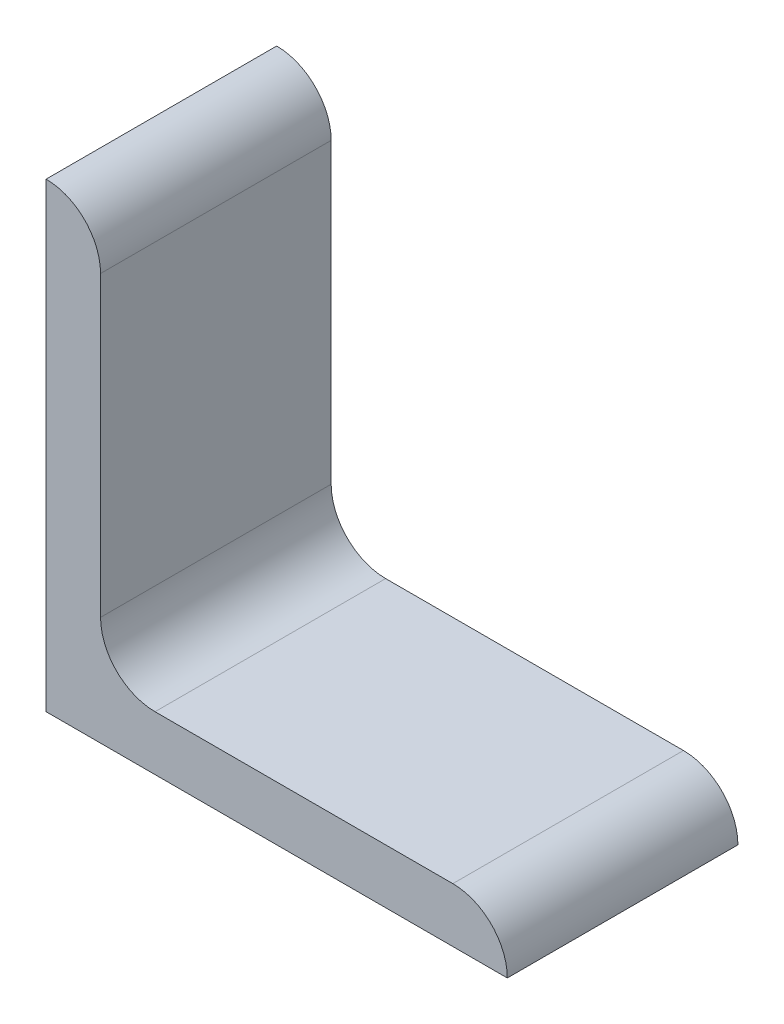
ISO-10303-21;
HEADER;
FILE_DESCRIPTION(('STEP AP214'),'2;1');
FILE_NAME('part.step','',(''),(''),'','','');
FILE_SCHEMA(('AUTOMOTIVE_DESIGN { 1 0 10303 214 1 1 1 1 }'));
ENDSEC;
DATA;
#1=APPLICATION_CONTEXT('core data for automotive mechanical design processes');
#2=APPLICATION_PROTOCOL_DEFINITION('international standard','automotive_design',2000,#1);
#3=PRODUCT_CONTEXT('',#1,'mechanical');
#4=PRODUCT('Part','Part','',(#3));
#5=PRODUCT_RELATED_PRODUCT_CATEGORY('part','',(#4));
#6=PRODUCT_DEFINITION_FORMATION('','',#4);
#7=PRODUCT_DEFINITION_CONTEXT('part definition',#1,'design');
#8=PRODUCT_DEFINITION('design','',#6,#7);
#9=PRODUCT_DEFINITION_SHAPE('','',#8);
#10=(LENGTH_UNIT() NAMED_UNIT(*) SI_UNIT(.MILLI.,.METRE.));
#11=(NAMED_UNIT(*) PLANE_ANGLE_UNIT() SI_UNIT($,.RADIAN.));
#12=(NAMED_UNIT(*) SI_UNIT($,.STERADIAN.) SOLID_ANGLE_UNIT());
#13=UNCERTAINTY_MEASURE_WITH_UNIT(LENGTH_MEASURE(1.E-05),#10,'distance_accuracy_value','');
#14=(GEOMETRIC_REPRESENTATION_CONTEXT(3) GLOBAL_UNCERTAINTY_ASSIGNED_CONTEXT((#13)) GLOBAL_UNIT_ASSIGNED_CONTEXT((#10,
#11,#12)) REPRESENTATION_CONTEXT('',''));
#15=CARTESIAN_POINT('',(0.,0.,0.));
#16=DIRECTION('',(0.,0.,1.));
#17=DIRECTION('',(1.,0.,0.));
#18=AXIS2_PLACEMENT_3D('',#15,#16,#17);
#19=CARTESIAN_POINT('',(50.7999999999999,0.,12.7));
#20=DIRECTION('',(0.,1.,0.));
#21=DIRECTION('',(0.,0.,1.));
#22=AXIS2_PLACEMENT_3D('',#19,#20,#21);
#23=PLANE('',#22);
#24=DIRECTION('',(1.,0.,0.));
#25=VECTOR('',#24,1.);
#26=CARTESIAN_POINT('',(50.7999999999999,0.,-12.7));
#27=LINE('',#26,#25);
#28=CARTESIAN_POINT('',(0.,0.,-12.7));
#29=VERTEX_POINT('',#28);
#30=CARTESIAN_POINT('',(50.7999999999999,0.,-12.7));
#31=VERTEX_POINT('',#30);
#32=EDGE_CURVE('E113',#29,#31,#27,.T.);
#33=ORIENTED_EDGE('',*,*,#32,.T.);
#34=DIRECTION('',(0.,0.,-1.));
#35=VECTOR('',#34,1.);
#36=CARTESIAN_POINT('',(50.7999999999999,0.,12.7));
#37=LINE('',#36,#35);
#38=CARTESIAN_POINT('',(50.7999999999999,0.,12.7));
#39=VERTEX_POINT('',#38);
#40=EDGE_CURVE('E111',#39,#31,#37,.T.);
#41=ORIENTED_EDGE('',*,*,#40,.F.);
#42=DIRECTION('',(1.,0.,0.));
#43=VECTOR('',#42,1.);
#44=CARTESIAN_POINT('',(50.7999999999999,0.,12.7));
#45=LINE('',#44,#43);
#46=CARTESIAN_POINT('',(0.,0.,12.7));
#47=VERTEX_POINT('',#46);
#48=EDGE_CURVE('E96',#47,#39,#45,.T.);
#49=ORIENTED_EDGE('',*,*,#48,.F.);
#50=DIRECTION('',(0.,0.,-1.));
#51=VECTOR('',#50,1.);
#52=CARTESIAN_POINT('',(0.,0.,12.7));
#53=LINE('',#52,#51);
#54=EDGE_CURVE('E132',#47,#29,#53,.T.);
#55=ORIENTED_EDGE('',*,*,#54,.T.);
#56=EDGE_LOOP('',(#33,#41,#49,#55));
#57=FACE_BOUND('',#56,.T.);
#58=ADVANCED_FACE('F39',(#57),#23,.F.);
#59=CARTESIAN_POINT('',(12.,5.99999999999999,12.7));
#60=DIRECTION('',(0.,-1.,0.));
#61=DIRECTION('',(1.,0.,0.));
#62=AXIS2_PLACEMENT_3D('',#59,#60,#61);
#63=PLANE('',#62);
#64=DIRECTION('',(-1.,0.,0.));
#65=VECTOR('',#64,1.);
#66=CARTESIAN_POINT('',(12.,5.99999999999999,12.7));
#67=LINE('',#66,#65);
#68=CARTESIAN_POINT('',(44.7999999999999,5.99999999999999,12.7));
#69=VERTEX_POINT('',#68);
#70=CARTESIAN_POINT('',(12.,6.,12.7));
#71=VERTEX_POINT('',#70);
#72=EDGE_CURVE('E106',#69,#71,#67,.T.);
#73=ORIENTED_EDGE('',*,*,#72,.F.);
#74=DIRECTION('',(0.,0.,-1.));
#75=VECTOR('',#74,1.);
#76=CARTESIAN_POINT('',(44.7999999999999,5.99999999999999,12.7));
#77=LINE('',#76,#75);
#78=CARTESIAN_POINT('',(44.7999999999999,5.99999999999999,-12.7));
#79=VERTEX_POINT('',#78);
#80=EDGE_CURVE('E11',#69,#79,#77,.T.);
#81=ORIENTED_EDGE('',*,*,#80,.T.);
#82=DIRECTION('',(-1.,0.,0.));
#83=VECTOR('',#82,1.);
#84=CARTESIAN_POINT('',(12.,5.99999999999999,-12.7));
#85=LINE('',#84,#83);
#86=CARTESIAN_POINT('',(12.,6.,-12.7));
#87=VERTEX_POINT('',#86);
#88=EDGE_CURVE('E136',#79,#87,#85,.T.);
#89=ORIENTED_EDGE('',*,*,#88,.T.);
#90=DIRECTION('',(0.,0.,-1.));
#91=VECTOR('',#90,1.);
#92=CARTESIAN_POINT('',(12.,6.,12.7));
#93=LINE('',#92,#91);
#94=EDGE_CURVE('E116',#71,#87,#93,.T.);
#95=ORIENTED_EDGE('',*,*,#94,.F.);
#96=EDGE_LOOP('',(#73,#81,#89,#95));
#97=FACE_BOUND('',#96,.T.);
#98=ADVANCED_FACE('F155',(#97),#63,.F.);
#99=CARTESIAN_POINT('',(12.,12.,12.7));
#100=DIRECTION('',(0.,0.,-1.));
#101=DIRECTION('',(-1.,0.,0.));
#102=AXIS2_PLACEMENT_3D('',#99,#100,#101);
#103=CYLINDRICAL_SURFACE('',#102,6.);
#104=CARTESIAN_POINT('',(12.,12.,-12.7));
#105=DIRECTION('',(0.,0.,-1.));
#106=DIRECTION('',(-1.,0.,0.));
#107=AXIS2_PLACEMENT_3D('',#104,#105,#106);
#108=CIRCLE('',#107,6.);
#109=CARTESIAN_POINT('',(6.,12.,-12.7));
#110=VERTEX_POINT('',#109);
#111=EDGE_CURVE('E138',#87,#110,#108,.T.);
#112=ORIENTED_EDGE('',*,*,#111,.T.);
#113=DIRECTION('',(0.,0.,-1.));
#114=VECTOR('',#113,1.);
#115=CARTESIAN_POINT('',(6.,12.,12.7));
#116=LINE('',#115,#114);
#117=CARTESIAN_POINT('',(6.,12.,12.7));
#118=VERTEX_POINT('',#117);
#119=EDGE_CURVE('E130',#118,#110,#116,.T.);
#120=ORIENTED_EDGE('',*,*,#119,.F.);
#121=CARTESIAN_POINT('',(12.,12.,12.7));
#122=DIRECTION('',(0.,0.,-1.));
#123=DIRECTION('',(-1.,0.,0.));
#124=AXIS2_PLACEMENT_3D('',#121,#122,#123);
#125=CIRCLE('',#124,6.);
#126=EDGE_CURVE('E146',#71,#118,#125,.T.);
#127=ORIENTED_EDGE('',*,*,#126,.F.);
#128=ORIENTED_EDGE('',*,*,#94,.T.);
#129=EDGE_LOOP('',(#112,#120,#127,#128));
#130=FACE_BOUND('',#129,.T.);
#131=ADVANCED_FACE('F157',(#130),#103,.F.);
#132=CARTESIAN_POINT('',(6.,50.8,12.7));
#133=DIRECTION('',(-1.,0.,0.));
#134=DIRECTION('',(0.,-1.,0.));
#135=AXIS2_PLACEMENT_3D('',#132,#133,#134);
#136=PLANE('',#135);
#137=DIRECTION('',(0.,1.,0.));
#138=VECTOR('',#137,1.);
#139=CARTESIAN_POINT('',(6.,50.8,-12.7));
#140=LINE('',#139,#138);
#141=CARTESIAN_POINT('',(6.,44.8,-12.7));
#142=VERTEX_POINT('',#141);
#143=EDGE_CURVE('E137',#110,#142,#140,.T.);
#144=ORIENTED_EDGE('',*,*,#143,.T.);
#145=DIRECTION('',(0.,0.,-1.));
#146=VECTOR('',#145,1.);
#147=CARTESIAN_POINT('',(6.,44.8,12.7));
#148=LINE('',#147,#146);
#149=CARTESIAN_POINT('',(6.,44.8,12.7));
#150=VERTEX_POINT('',#149);
#151=EDGE_CURVE('E65',#142,#150,#148,.F.);
#152=ORIENTED_EDGE('',*,*,#151,.T.);
#153=DIRECTION('',(0.,1.,0.));
#154=VECTOR('',#153,1.);
#155=CARTESIAN_POINT('',(6.,50.8,12.7));
#156=LINE('',#155,#154);
#157=EDGE_CURVE('E144',#118,#150,#156,.T.);
#158=ORIENTED_EDGE('',*,*,#157,.F.);
#159=ORIENTED_EDGE('',*,*,#119,.T.);
#160=EDGE_LOOP('',(#144,#152,#158,#159));
#161=FACE_BOUND('',#160,.T.);
#162=ADVANCED_FACE('F158',(#161),#136,.F.);
#163=CARTESIAN_POINT('',(0.,50.8,12.7));
#164=DIRECTION('',(1.,0.,0.));
#165=DIRECTION('',(0.,1.,0.));
#166=AXIS2_PLACEMENT_3D('',#163,#164,#165);
#167=PLANE('',#166);
#168=DIRECTION('',(0.,-1.,0.));
#169=VECTOR('',#168,1.);
#170=CARTESIAN_POINT('',(0.,50.8,-12.7));
#171=LINE('',#170,#169);
#172=CARTESIAN_POINT('',(0.,50.8,-12.7));
#173=VERTEX_POINT('',#172);
#174=EDGE_CURVE('E110',#173,#29,#171,.T.);
#175=ORIENTED_EDGE('',*,*,#174,.T.);
#176=ORIENTED_EDGE('',*,*,#54,.F.);
#177=DIRECTION('',(0.,-1.,0.));
#178=VECTOR('',#177,1.);
#179=CARTESIAN_POINT('',(0.,50.8,12.7));
#180=LINE('',#179,#178);
#181=CARTESIAN_POINT('',(0.,50.8,12.7));
#182=VERTEX_POINT('',#181);
#183=EDGE_CURVE('E105',#182,#47,#180,.T.);
#184=ORIENTED_EDGE('',*,*,#183,.F.);
#185=DIRECTION('',(0.,0.,-1.));
#186=VECTOR('',#185,1.);
#187=CARTESIAN_POINT('',(0.,50.8,12.7));
#188=LINE('',#187,#186);
#189=EDGE_CURVE('E129',#182,#173,#188,.T.);
#190=ORIENTED_EDGE('',*,*,#189,.T.);
#191=EDGE_LOOP('',(#175,#176,#184,#190));
#192=FACE_BOUND('',#191,.T.);
#193=ADVANCED_FACE('F164',(#192),#167,.F.);
#194=CARTESIAN_POINT('',(12.,12.,12.7));
#195=DIRECTION('',(0.,0.,-1.));
#196=DIRECTION('',(-1.,0.,0.));
#197=AXIS2_PLACEMENT_3D('',#194,#195,#196);
#198=PLANE('',#197);
#199=ORIENTED_EDGE('',*,*,#157,.T.);
#200=CARTESIAN_POINT('',(0.,44.8,12.7));
#201=DIRECTION('',(0.,0.,-1.));
#202=DIRECTION('',(-1.,0.,0.));
#203=AXIS2_PLACEMENT_3D('',#200,#201,#202);
#204=CIRCLE('',#203,6.);
#205=EDGE_CURVE('E50',#150,#182,#204,.F.);
#206=ORIENTED_EDGE('',*,*,#205,.T.);
#207=ORIENTED_EDGE('',*,*,#183,.T.);
#208=ORIENTED_EDGE('',*,*,#48,.T.);
#209=CARTESIAN_POINT('',(44.7999999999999,0.,12.7));
#210=DIRECTION('',(0.,0.,-1.));
#211=DIRECTION('',(-1.,0.,0.));
#212=AXIS2_PLACEMENT_3D('',#209,#210,#211);
#213=CIRCLE('',#212,6.);
#214=EDGE_CURVE('E53',#39,#69,#213,.F.);
#215=ORIENTED_EDGE('',*,*,#214,.T.);
#216=ORIENTED_EDGE('',*,*,#72,.T.);
#217=ORIENTED_EDGE('',*,*,#126,.T.);
#218=EDGE_LOOP('',(#199,#206,#207,#208,#215,#216,#217));
#219=FACE_BOUND('',#218,.T.);
#220=ADVANCED_FACE('F99',(#219),#198,.F.);
#221=CARTESIAN_POINT('',(12.,12.,-12.7));
#222=DIRECTION('',(0.,0.,-1.));
#223=DIRECTION('',(-1.,0.,0.));
#224=AXIS2_PLACEMENT_3D('',#221,#222,#223);
#225=PLANE('',#224);
#226=ORIENTED_EDGE('',*,*,#174,.F.);
#227=CARTESIAN_POINT('',(0.,44.8,-12.7));
#228=DIRECTION('',(0.,0.,-1.));
#229=DIRECTION('',(-1.,0.,0.));
#230=AXIS2_PLACEMENT_3D('',#227,#228,#229);
#231=CIRCLE('',#230,6.);
#232=EDGE_CURVE('E119',#173,#142,#231,.T.);
#233=ORIENTED_EDGE('',*,*,#232,.T.);
#234=ORIENTED_EDGE('',*,*,#143,.F.);
#235=ORIENTED_EDGE('',*,*,#111,.F.);
#236=ORIENTED_EDGE('',*,*,#88,.F.);
#237=CARTESIAN_POINT('',(44.7999999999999,0.,-12.7));
#238=DIRECTION('',(0.,0.,-1.));
#239=DIRECTION('',(-1.,0.,0.));
#240=AXIS2_PLACEMENT_3D('',#237,#238,#239);
#241=CIRCLE('',#240,6.);
#242=EDGE_CURVE('E114',#79,#31,#241,.T.);
#243=ORIENTED_EDGE('',*,*,#242,.T.);
#244=ORIENTED_EDGE('',*,*,#32,.F.);
#245=EDGE_LOOP('',(#226,#233,#234,#235,#236,#243,#244));
#246=FACE_BOUND('',#245,.T.);
#247=ADVANCED_FACE('F170',(#246),#225,.T.);
#248=CARTESIAN_POINT('',(0.,44.8,12.7));
#249=DIRECTION('',(0.,0.,-1.));
#250=DIRECTION('',(-1.,0.,0.));
#251=AXIS2_PLACEMENT_3D('',#248,#249,#250);
#252=CYLINDRICAL_SURFACE('',#251,6.);
#253=ORIENTED_EDGE('',*,*,#205,.F.);
#254=ORIENTED_EDGE('',*,*,#151,.F.);
#255=ORIENTED_EDGE('',*,*,#232,.F.);
#256=ORIENTED_EDGE('',*,*,#189,.F.);
#257=EDGE_LOOP('',(#253,#254,#255,#256));
#258=FACE_BOUND('',#257,.T.);
#259=ADVANCED_FACE('F162',(#258),#252,.T.);
#260=CARTESIAN_POINT('',(44.7999999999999,0.,12.7));
#261=DIRECTION('',(0.,0.,-1.));
#262=DIRECTION('',(-1.,0.,0.));
#263=AXIS2_PLACEMENT_3D('',#260,#261,#262);
#264=CYLINDRICAL_SURFACE('',#263,6.);
#265=ORIENTED_EDGE('',*,*,#214,.F.);
#266=ORIENTED_EDGE('',*,*,#40,.T.);
#267=ORIENTED_EDGE('',*,*,#242,.F.);
#268=ORIENTED_EDGE('',*,*,#80,.F.);
#269=EDGE_LOOP('',(#265,#266,#267,#268));
#270=FACE_BOUND('',#269,.T.);
#271=ADVANCED_FACE('F41',(#270),#264,.T.);
#272=CLOSED_SHELL('',(#58,#98,#131,#162,#193,#220,#247,#259,#271));
#273=MANIFOLD_SOLID_BREP('B2',#272);
#274=ADVANCED_BREP_SHAPE_REPRESENTATION('',(#18,#273),#14);
#275=SHAPE_DEFINITION_REPRESENTATION(#9,#274);
ENDSEC;
END-ISO-10303-21;
